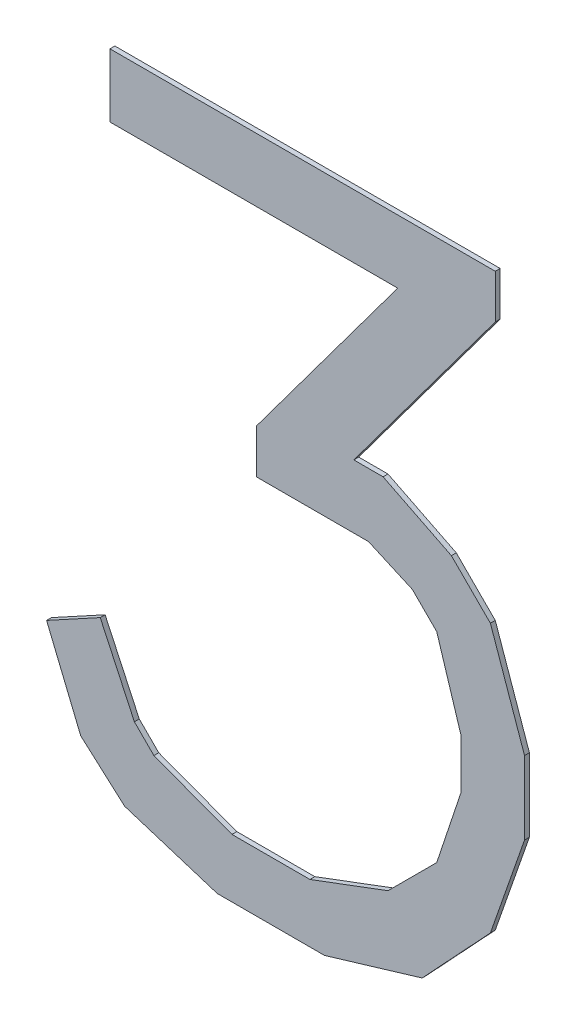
ISO-10303-21;
HEADER;
FILE_DESCRIPTION(('STEP AP214'),'2;1');
FILE_NAME('part.step','',(''),(''),'','','');
FILE_SCHEMA(('AUTOMOTIVE_DESIGN { 1 0 10303 214 1 1 1 1 }'));
ENDSEC;
DATA;
#1=APPLICATION_CONTEXT('core data for automotive mechanical design processes');
#2=APPLICATION_PROTOCOL_DEFINITION('international standard','automotive_design',2000,#1);
#3=PRODUCT_CONTEXT('',#1,'mechanical');
#4=PRODUCT('Part','Part','',(#3));
#5=PRODUCT_RELATED_PRODUCT_CATEGORY('part','',(#4));
#6=PRODUCT_DEFINITION_FORMATION('','',#4);
#7=PRODUCT_DEFINITION_CONTEXT('part definition',#1,'design');
#8=PRODUCT_DEFINITION('design','',#6,#7);
#9=PRODUCT_DEFINITION_SHAPE('','',#8);
#10=(LENGTH_UNIT() NAMED_UNIT(*) SI_UNIT(.MILLI.,.METRE.));
#11=(NAMED_UNIT(*) PLANE_ANGLE_UNIT() SI_UNIT($,.RADIAN.));
#12=(NAMED_UNIT(*) SI_UNIT($,.STERADIAN.) SOLID_ANGLE_UNIT());
#13=UNCERTAINTY_MEASURE_WITH_UNIT(LENGTH_MEASURE(1.E-05),#10,'distance_accuracy_value','');
#14=(GEOMETRIC_REPRESENTATION_CONTEXT(3) GLOBAL_UNCERTAINTY_ASSIGNED_CONTEXT((#13)) GLOBAL_UNIT_ASSIGNED_CONTEXT((#10,
#11,#12)) REPRESENTATION_CONTEXT('',''));
#15=CARTESIAN_POINT('',(0.,0.,0.));
#16=DIRECTION('',(0.,0.,1.));
#17=DIRECTION('',(1.,0.,0.));
#18=AXIS2_PLACEMENT_3D('',#15,#16,#17);
#19=CARTESIAN_POINT('',(-0.35999928,0.69499988,0.));
#20=DIRECTION('',(0.,0.,1.));
#21=DIRECTION('',(1.,0.,0.));
#22=AXIS2_PLACEMENT_3D('',#19,#20,#21);
#23=PLANE('',#22);
#24=DIRECTION('',(0.,1.,0.));
#25=VECTOR('',#24,1.);
#26=CARTESIAN_POINT('',(0.43000168,0.69499988,0.));
#27=LINE('',#26,#25);
#28=CARTESIAN_POINT('',(0.43000168,0.60500006,0.));
#29=VERTEX_POINT('',#28);
#30=CARTESIAN_POINT('',(0.43000168,0.69499988,0.));
#31=VERTEX_POINT('',#30);
#32=EDGE_CURVE('E387',#29,#31,#27,.T.);
#33=ORIENTED_EDGE('',*,*,#32,.F.);
#34=DIRECTION('',(0.59670362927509,0.802461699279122,0.));
#35=VECTOR('',#34,1.);
#36=CARTESIAN_POINT('',(0.43000168,0.60500006,0.));
#37=LINE('',#36,#35);
#38=CARTESIAN_POINT('',(0.139999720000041,0.21499829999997,0.));
#39=VERTEX_POINT('',#38);
#40=EDGE_CURVE('E382',#39,#29,#37,.T.);
#41=ORIENTED_EDGE('',*,*,#40,.F.);
#42=DIRECTION('',(1.,0.,0.));
#43=VECTOR('',#42,1.);
#44=CARTESIAN_POINT('',(0.13999972,0.2149983,0.));
#45=LINE('',#44,#43);
#46=CARTESIAN_POINT('',(0.20000214,0.2149983,0.));
#47=VERTEX_POINT('',#46);
#48=EDGE_CURVE('E377',#47,#39,#45,.F.);
#49=ORIENTED_EDGE('',*,*,#48,.F.);
#50=DIRECTION('',(-0.894427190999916,0.447213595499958,0.));
#51=VECTOR('',#50,1.);
#52=CARTESIAN_POINT('',(0.20000214,0.2149983,0.));
#53=LINE('',#52,#51);
#54=CARTESIAN_POINT('',(0.34000186,0.14499844,0.));
#55=VERTEX_POINT('',#54);
#56=EDGE_CURVE('E372',#55,#47,#53,.T.);
#57=ORIENTED_EDGE('',*,*,#56,.F.);
#58=DIRECTION('',(-0.707106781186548,0.707106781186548,0.));
#59=VECTOR('',#58,1.);
#60=CARTESIAN_POINT('',(0.34000186,0.14499844,0.));
#61=LINE('',#60,#59);
#62=CARTESIAN_POINT('',(0.4200017,0.0649986,0.));
#63=VERTEX_POINT('',#62);
#64=EDGE_CURVE('E367',#63,#55,#61,.T.);
#65=ORIENTED_EDGE('',*,*,#64,.F.);
#66=DIRECTION('',(-0.330350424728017,0.943858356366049,0.));
#67=VECTOR('',#66,1.);
#68=CARTESIAN_POINT('',(0.4200017,0.0649986,0.));
#69=LINE('',#68,#67);
#70=CARTESIAN_POINT('',(0.490001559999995,-0.135001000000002,0.));
#71=VERTEX_POINT('',#70);
#72=EDGE_CURVE('E362',#71,#63,#69,.T.);
#73=ORIENTED_EDGE('',*,*,#72,.F.);
#74=DIRECTION('',(0.,1.,0.));
#75=VECTOR('',#74,1.);
#76=CARTESIAN_POINT('',(0.49000156,-0.135001,0.));
#77=LINE('',#76,#75);
#78=CARTESIAN_POINT('',(0.49000156,-0.2850007,0.));
#79=VERTEX_POINT('',#78);
#80=EDGE_CURVE('E357',#79,#71,#77,.T.);
#81=ORIENTED_EDGE('',*,*,#80,.F.);
#82=DIRECTION('',(0.330350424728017,0.943858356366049,0.));
#83=VECTOR('',#82,1.);
#84=CARTESIAN_POINT('',(0.49000156,-0.2850007,0.));
#85=LINE('',#84,#83);
#86=CARTESIAN_POINT('',(0.420001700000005,-0.485000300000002,0.));
#87=VERTEX_POINT('',#86);
#88=EDGE_CURVE('E352',#87,#79,#85,.T.);
#89=ORIENTED_EDGE('',*,*,#88,.F.);
#90=DIRECTION('',(0.68231825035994,0.731055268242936,0.));
#91=VECTOR('',#90,1.);
#92=CARTESIAN_POINT('',(0.4200017,-0.4850003,0.));
#93=LINE('',#92,#91);
#94=CARTESIAN_POINT('',(0.280001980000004,-0.635000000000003,0.));
#95=VERTEX_POINT('',#94);
#96=EDGE_CURVE('E347',#95,#87,#93,.T.);
#97=ORIENTED_EDGE('',*,*,#96,.F.);
#98=DIRECTION('',(0.957827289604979,0.287344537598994,0.));
#99=VECTOR('',#98,1.);
#100=CARTESIAN_POINT('',(0.28000198,-0.635,0.));
#101=LINE('',#100,#99);
#102=CARTESIAN_POINT('',(0.0799998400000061,-0.694999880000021,0.));
#103=VERTEX_POINT('',#102);
#104=EDGE_CURVE('E342',#103,#95,#101,.T.);
#105=ORIENTED_EDGE('',*,*,#104,.F.);
#106=DIRECTION('',(1.,0.,0.));
#107=VECTOR('',#106,1.);
#108=CARTESIAN_POINT('',(0.07999984,-0.69499988,0.));
#109=LINE('',#108,#107);
#110=CARTESIAN_POINT('',(-0.13999972,-0.69499988,0.));
#111=VERTEX_POINT('',#110);
#112=EDGE_CURVE('E337',#111,#103,#109,.T.);
#113=ORIENTED_EDGE('',*,*,#112,.F.);
#114=DIRECTION('',(0.953582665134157,-0.30113136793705,0.));
#115=VECTOR('',#114,1.);
#116=CARTESIAN_POINT('',(-0.13999972,-0.69499988,0.));
#117=LINE('',#116,#115);
#118=CARTESIAN_POINT('',(-0.329999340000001,-0.635000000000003,0.));
#119=VERTEX_POINT('',#118);
#120=EDGE_CURVE('E332',#119,#111,#117,.T.);
#121=ORIENTED_EDGE('',*,*,#120,.F.);
#122=DIRECTION('',(0.74740931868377,-0.664363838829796,0.));
#123=VECTOR('',#122,1.);
#124=CARTESIAN_POINT('',(-0.32999934,-0.635,0.));
#125=LINE('',#124,#123);
#126=CARTESIAN_POINT('',(-0.419999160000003,-0.555000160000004,0.));
#127=VERTEX_POINT('',#126);
#128=EDGE_CURVE('E327',#127,#119,#125,.T.);
#129=ORIENTED_EDGE('',*,*,#128,.F.);
#130=DIRECTION('',(0.380749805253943,-0.924678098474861,0.));
#131=VECTOR('',#130,1.);
#132=CARTESIAN_POINT('',(-0.41999916,-0.55500016,0.));
#133=LINE('',#132,#131);
#134=CARTESIAN_POINT('',(-0.489999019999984,-0.385000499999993,0.));
#135=VERTEX_POINT('',#134);
#136=EDGE_CURVE('E322',#135,#127,#133,.T.);
#137=ORIENTED_EDGE('',*,*,#136,.F.);
#138=DIRECTION('',(-0.877895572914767,-0.478852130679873,0.));
#139=VECTOR('',#138,1.);
#140=CARTESIAN_POINT('',(-0.48999902,-0.3850005,0.));
#141=LINE('',#140,#139);
#142=CARTESIAN_POINT('',(-0.379999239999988,-0.325000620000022,0.));
#143=VERTEX_POINT('',#142);
#144=EDGE_CURVE('E317',#143,#135,#141,.T.);
#145=ORIENTED_EDGE('',*,*,#144,.F.);
#146=DIRECTION('',(-0.422885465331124,0.906183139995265,0.));
#147=VECTOR('',#146,1.);
#148=CARTESIAN_POINT('',(-0.37999924,-0.32500062,0.));
#149=LINE('',#148,#147);
#150=CARTESIAN_POINT('',(-0.30999938,-0.47500032,0.));
#151=VERTEX_POINT('',#150);
#152=EDGE_CURVE('E312',#151,#143,#149,.T.);
#153=ORIENTED_EDGE('',*,*,#152,.F.);
#154=DIRECTION('',(-0.707106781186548,0.707106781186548,0.));
#155=VECTOR('',#154,1.);
#156=CARTESIAN_POINT('',(-0.30999938,-0.47500032,0.));
#157=LINE('',#156,#155);
#158=CARTESIAN_POINT('',(-0.26999946,-0.51500024,0.));
#159=VERTEX_POINT('',#158);
#160=EDGE_CURVE('E307',#159,#151,#157,.T.);
#161=ORIENTED_EDGE('',*,*,#160,.F.);
#162=DIRECTION('',(-0.936329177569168,0.351123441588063,0.));
#163=VECTOR('',#162,1.);
#164=CARTESIAN_POINT('',(-0.26999946,-0.51500024,0.));
#165=LINE('',#164,#163);
#166=CARTESIAN_POINT('',(-0.109999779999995,-0.575000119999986,0.));
#167=VERTEX_POINT('',#166);
#168=EDGE_CURVE('E302',#167,#159,#165,.T.);
#169=ORIENTED_EDGE('',*,*,#168,.F.);
#170=DIRECTION('',(1.,0.,0.));
#171=VECTOR('',#170,1.);
#172=CARTESIAN_POINT('',(-0.10999978,-0.57500012,0.));
#173=LINE('',#172,#171);
#174=CARTESIAN_POINT('',(0.04999989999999,-0.57500012,0.));
#175=VERTEX_POINT('',#174);
#176=EDGE_CURVE('E297',#175,#167,#173,.F.);
#177=ORIENTED_EDGE('',*,*,#176,.F.);
#178=DIRECTION('',(-0.936331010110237,-0.351118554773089,0.));
#179=VECTOR('',#178,1.);
#180=CARTESIAN_POINT('',(0.04999989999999,-0.57500012,0.));
#181=LINE('',#180,#179);
#182=CARTESIAN_POINT('',(0.21000212,-0.515000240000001,0.));
#183=VERTEX_POINT('',#182);
#184=EDGE_CURVE('E292',#183,#175,#181,.T.);
#185=ORIENTED_EDGE('',*,*,#184,.F.);
#186=DIRECTION('',(-0.707106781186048,-0.707106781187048,0.));
#187=VECTOR('',#186,1.);
#188=CARTESIAN_POINT('',(0.21000212,-0.51500024,0.));
#189=LINE('',#188,#187);
#190=CARTESIAN_POINT('',(0.310001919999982,-0.415000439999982,0.));
#191=VERTEX_POINT('',#190);
#192=EDGE_CURVE('E287',#191,#183,#189,.T.);
#193=ORIENTED_EDGE('',*,*,#192,.F.);
#194=DIRECTION('',(-0.316227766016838,-0.948683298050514,0.));
#195=VECTOR('',#194,1.);
#196=CARTESIAN_POINT('',(0.31000192,-0.41500044,0.));
#197=LINE('',#196,#195);
#198=CARTESIAN_POINT('',(0.36000182,-0.26500074,0.));
#199=VERTEX_POINT('',#198);
#200=EDGE_CURVE('E282',#199,#191,#197,.T.);
#201=ORIENTED_EDGE('',*,*,#200,.F.);
#202=DIRECTION('',(0.,1.,0.));
#203=VECTOR('',#202,1.);
#204=CARTESIAN_POINT('',(0.36000182,-0.26500074,0.));
#205=LINE('',#204,#203);
#206=CARTESIAN_POINT('',(0.36000182,-0.16500094,0.));
#207=VERTEX_POINT('',#206);
#208=EDGE_CURVE('E277',#207,#199,#205,.F.);
#209=ORIENTED_EDGE('',*,*,#208,.F.);
#210=DIRECTION('',(0.298274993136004,-0.954479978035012,0.));
#211=VECTOR('',#210,1.);
#212=CARTESIAN_POINT('',(0.36000182,-0.16500094,0.));
#213=LINE('',#212,#211);
#214=CARTESIAN_POINT('',(0.310001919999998,-0.00500126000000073,0.));
#215=VERTEX_POINT('',#214);
#216=EDGE_CURVE('E272',#215,#207,#213,.T.);
#217=ORIENTED_EDGE('',*,*,#216,.F.);
#218=DIRECTION('',(0.707106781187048,-0.707106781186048,0.));
#219=VECTOR('',#218,1.);
#220=CARTESIAN_POINT('',(0.31000192,-0.00500126,0.));
#221=LINE('',#220,#219);
#222=CARTESIAN_POINT('',(0.260002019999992,0.0449986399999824,0.));
#223=VERTEX_POINT('',#222);
#224=EDGE_CURVE('E267',#223,#215,#221,.T.);
#225=ORIENTED_EDGE('',*,*,#224,.F.);
#226=DIRECTION('',(0.913815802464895,-0.406128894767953,0.));
#227=VECTOR('',#226,1.);
#228=CARTESIAN_POINT('',(0.26000202,0.04499863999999,0.));
#229=LINE('',#228,#227);
#230=CARTESIAN_POINT('',(0.169999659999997,0.0849985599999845,0.));
#231=VERTEX_POINT('',#230);
#232=EDGE_CURVE('E262',#231,#223,#229,.T.);
#233=ORIENTED_EDGE('',*,*,#232,.F.);
#234=DIRECTION('',(1.,0.,0.));
#235=VECTOR('',#234,1.);
#236=CARTESIAN_POINT('',(0.16999966,0.08499855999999,0.));
#237=LINE('',#236,#235);
#238=CARTESIAN_POINT('',(-0.05999988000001,0.08499855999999,0.));
#239=VERTEX_POINT('',#238);
#240=EDGE_CURVE('E257',#239,#231,#237,.T.);
#241=ORIENTED_EDGE('',*,*,#240,.F.);
#242=DIRECTION('',(0.,1.,0.));
#243=VECTOR('',#242,1.);
#244=CARTESIAN_POINT('',(-0.05999988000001,0.08499855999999,0.));
#245=LINE('',#244,#243);
#246=CARTESIAN_POINT('',(-0.05999988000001,0.17499838,0.));
#247=VERTEX_POINT('',#246);
#248=EDGE_CURVE('E252',#247,#239,#245,.F.);
#249=ORIENTED_EDGE('',*,*,#248,.F.);
#250=DIRECTION('',(-0.59670362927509,-0.802461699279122,0.));
#251=VECTOR('',#250,1.);
#252=CARTESIAN_POINT('',(-0.05999988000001,0.17499838,0.));
#253=LINE('',#252,#251);
#254=CARTESIAN_POINT('',(0.230002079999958,0.565000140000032,0.));
#255=VERTEX_POINT('',#254);
#256=EDGE_CURVE('E238',#255,#247,#253,.T.);
#257=ORIENTED_EDGE('',*,*,#256,.F.);
#258=DIRECTION('',(1.,0.,0.));
#259=VECTOR('',#258,1.);
#260=CARTESIAN_POINT('',(0.23000208,0.56500014,0.));
#261=LINE('',#260,#259);
#262=CARTESIAN_POINT('',(-0.35999928,0.56500014,0.));
#263=VERTEX_POINT('',#262);
#264=EDGE_CURVE('E223',#263,#255,#261,.T.);
#265=ORIENTED_EDGE('',*,*,#264,.F.);
#266=DIRECTION('',(0.,1.,0.));
#267=VECTOR('',#266,1.);
#268=CARTESIAN_POINT('',(-0.35999928,0.56500014,0.));
#269=LINE('',#268,#267);
#270=CARTESIAN_POINT('',(-0.35999928,0.69499988,0.));
#271=VERTEX_POINT('',#270);
#272=EDGE_CURVE('E20',#271,#263,#269,.F.);
#273=ORIENTED_EDGE('',*,*,#272,.F.);
#274=DIRECTION('',(1.,0.,0.));
#275=VECTOR('',#274,1.);
#276=CARTESIAN_POINT('',(-0.35999928,0.69499988,0.));
#277=LINE('',#276,#275);
#278=EDGE_CURVE('E391',#31,#271,#277,.F.);
#279=ORIENTED_EDGE('',*,*,#278,.F.);
#280=EDGE_LOOP('',(#33,#41,#49,#57,#65,#73,#81,#89,#97,#105,#113,#121,#129,#137,#145,#153,#161,
#169,#177,#185,#193,#201,#209,#217,#225,#233,#241,#249,#257,#265,#273,#279));
#281=FACE_BOUND('',#280,.T.);
#282=ADVANCED_FACE('F17',(#281),#23,.F.);
#283=CARTESIAN_POINT('',(-0.35999928,0.56500014,0.));
#284=DIRECTION('',(-1.,0.,0.));
#285=DIRECTION('',(0.,0.,1.));
#286=AXIS2_PLACEMENT_3D('',#283,#284,#285);
#287=PLANE('',#286);
#288=DIRECTION('',(0.,0.,1.));
#289=VECTOR('',#288,1.);
#290=CARTESIAN_POINT('',(-0.35999928,0.69499988,0.));
#291=LINE('',#290,#289);
#292=CARTESIAN_POINT('',(-0.35999928,0.69499988,0.01));
#293=VERTEX_POINT('',#292);
#294=EDGE_CURVE('E232',#271,#293,#291,.T.);
#295=ORIENTED_EDGE('',*,*,#294,.F.);
#296=ORIENTED_EDGE('',*,*,#272,.T.);
#297=DIRECTION('',(0.,0.,-1.));
#298=VECTOR('',#297,1.);
#299=CARTESIAN_POINT('',(-0.35999928,0.56500014,0.));
#300=LINE('',#299,#298);
#301=CARTESIAN_POINT('',(-0.35999928,0.56500014,0.01));
#302=VERTEX_POINT('',#301);
#303=EDGE_CURVE('E229',#302,#263,#300,.T.);
#304=ORIENTED_EDGE('',*,*,#303,.F.);
#305=DIRECTION('',(0.,1.,0.));
#306=VECTOR('',#305,1.);
#307=CARTESIAN_POINT('',(-0.35999928,0.69499988,0.01));
#308=LINE('',#307,#306);
#309=EDGE_CURVE('E393',#293,#302,#308,.F.);
#310=ORIENTED_EDGE('',*,*,#309,.F.);
#311=EDGE_LOOP('',(#295,#296,#304,#310));
#312=FACE_BOUND('',#311,.T.);
#313=ADVANCED_FACE('F228',(#312),#287,.T.);
#314=CARTESIAN_POINT('',(0.23000208,0.56500014,0.));
#315=DIRECTION('',(0.,-1.,0.));
#316=DIRECTION('',(0.,0.,-1.));
#317=AXIS2_PLACEMENT_3D('',#314,#315,#316);
#318=PLANE('',#317);
#319=ORIENTED_EDGE('',*,*,#303,.T.);
#320=ORIENTED_EDGE('',*,*,#264,.T.);
#321=DIRECTION('',(0.,0.,1.));
#322=VECTOR('',#321,1.);
#323=CARTESIAN_POINT('',(0.230002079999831,0.565000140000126,0.));
#324=LINE('',#323,#322);
#325=CARTESIAN_POINT('',(0.230002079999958,0.565000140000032,0.01));
#326=VERTEX_POINT('',#325);
#327=EDGE_CURVE('E240',#326,#255,#324,.F.);
#328=ORIENTED_EDGE('',*,*,#327,.F.);
#329=DIRECTION('',(1.,0.,0.));
#330=VECTOR('',#329,1.);
#331=CARTESIAN_POINT('',(-0.35999928,0.56500014,0.01));
#332=LINE('',#331,#330);
#333=EDGE_CURVE('E244',#302,#326,#332,.T.);
#334=ORIENTED_EDGE('',*,*,#333,.F.);
#335=EDGE_LOOP('',(#319,#320,#328,#334));
#336=FACE_BOUND('',#335,.T.);
#337=ADVANCED_FACE('F242',(#336),#318,.T.);
#338=CARTESIAN_POINT('',(-0.05999988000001,0.17499838,0.));
#339=DIRECTION('',(-0.802461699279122,0.59670362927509,0.));
#340=DIRECTION('',(-0.59670362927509,-0.802461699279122,0.));
#341=AXIS2_PLACEMENT_3D('',#338,#339,#340);
#342=PLANE('',#341);
#343=ORIENTED_EDGE('',*,*,#327,.T.);
#344=ORIENTED_EDGE('',*,*,#256,.T.);
#345=DIRECTION('',(0.,0.,1.));
#346=VECTOR('',#345,1.);
#347=CARTESIAN_POINT('',(-0.05999988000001,0.17499838,0.));
#348=LINE('',#347,#346);
#349=CARTESIAN_POINT('',(-0.05999988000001,0.17499838,0.01));
#350=VERTEX_POINT('',#349);
#351=EDGE_CURVE('E249',#350,#247,#348,.F.);
#352=ORIENTED_EDGE('',*,*,#351,.F.);
#353=DIRECTION('',(-0.596703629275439,-0.802461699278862,0.));
#354=VECTOR('',#353,1.);
#355=CARTESIAN_POINT('',(0.23000208,0.56500014,0.01));
#356=LINE('',#355,#354);
#357=EDGE_CURVE('E396',#326,#350,#356,.T.);
#358=ORIENTED_EDGE('',*,*,#357,.F.);
#359=EDGE_LOOP('',(#343,#344,#352,#358));
#360=FACE_BOUND('',#359,.T.);
#361=ADVANCED_FACE('F606',(#360),#342,.T.);
#362=CARTESIAN_POINT('',(-0.05999988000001,0.08499855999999,0.));
#363=DIRECTION('',(-1.,0.,0.));
#364=DIRECTION('',(0.,0.,1.));
#365=AXIS2_PLACEMENT_3D('',#362,#363,#364);
#366=PLANE('',#365);
#367=ORIENTED_EDGE('',*,*,#351,.T.);
#368=ORIENTED_EDGE('',*,*,#248,.T.);
#369=DIRECTION('',(0.,0.,-1.));
#370=VECTOR('',#369,1.);
#371=CARTESIAN_POINT('',(-0.05999988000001,0.08499855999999,0.));
#372=LINE('',#371,#370);
#373=CARTESIAN_POINT('',(-0.05999988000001,0.08499855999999,0.01));
#374=VERTEX_POINT('',#373);
#375=EDGE_CURVE('E254',#374,#239,#372,.T.);
#376=ORIENTED_EDGE('',*,*,#375,.F.);
#377=DIRECTION('',(0.,1.,0.));
#378=VECTOR('',#377,1.);
#379=CARTESIAN_POINT('',(-0.05999988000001,0.69499988,0.01));
#380=LINE('',#379,#378);
#381=EDGE_CURVE('E399',#350,#374,#380,.F.);
#382=ORIENTED_EDGE('',*,*,#381,.F.);
#383=EDGE_LOOP('',(#367,#368,#376,#382));
#384=FACE_BOUND('',#383,.T.);
#385=ADVANCED_FACE('F602',(#384),#366,.T.);
#386=CARTESIAN_POINT('',(0.16999966,0.08499855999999,0.));
#387=DIRECTION('',(0.,-1.,0.));
#388=DIRECTION('',(0.,0.,-1.));
#389=AXIS2_PLACEMENT_3D('',#386,#387,#388);
#390=PLANE('',#389);
#391=ORIENTED_EDGE('',*,*,#375,.T.);
#392=ORIENTED_EDGE('',*,*,#240,.T.);
#393=DIRECTION('',(0.,0.,1.));
#394=VECTOR('',#393,1.);
#395=CARTESIAN_POINT('',(0.16999965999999,0.0849985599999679,0.));
#396=LINE('',#395,#394);
#397=CARTESIAN_POINT('',(0.169999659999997,0.0849985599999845,0.01));
#398=VERTEX_POINT('',#397);
#399=EDGE_CURVE('E259',#398,#231,#396,.F.);
#400=ORIENTED_EDGE('',*,*,#399,.F.);
#401=DIRECTION('',(1.,0.,0.));
#402=VECTOR('',#401,1.);
#403=CARTESIAN_POINT('',(-0.35999928,0.08499855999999,0.01));
#404=LINE('',#403,#402);
#405=EDGE_CURVE('E402',#374,#398,#404,.T.);
#406=ORIENTED_EDGE('',*,*,#405,.F.);
#407=EDGE_LOOP('',(#391,#392,#400,#406));
#408=FACE_BOUND('',#407,.T.);
#409=ADVANCED_FACE('F598',(#408),#390,.T.);
#410=CARTESIAN_POINT('',(0.26000202,0.04499863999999,0.));
#411=DIRECTION('',(-0.406128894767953,-0.913815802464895,0.));
#412=DIRECTION('',(0.913815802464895,-0.406128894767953,0.));
#413=AXIS2_PLACEMENT_3D('',#410,#411,#412);
#414=PLANE('',#413);
#415=ORIENTED_EDGE('',*,*,#399,.T.);
#416=ORIENTED_EDGE('',*,*,#232,.T.);
#417=DIRECTION('',(0.,0.,1.));
#418=VECTOR('',#417,1.);
#419=CARTESIAN_POINT('',(0.26000201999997,0.0449986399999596,0.));
#420=LINE('',#419,#418);
#421=CARTESIAN_POINT('',(0.260002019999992,0.0449986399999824,0.01));
#422=VERTEX_POINT('',#421);
#423=EDGE_CURVE('E264',#422,#223,#420,.F.);
#424=ORIENTED_EDGE('',*,*,#423,.F.);
#425=DIRECTION('',(0.913815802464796,-0.406128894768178,0.));
#426=VECTOR('',#425,1.);
#427=CARTESIAN_POINT('',(0.16999966,0.08499855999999,0.01));
#428=LINE('',#427,#426);
#429=EDGE_CURVE('E405',#398,#422,#428,.T.);
#430=ORIENTED_EDGE('',*,*,#429,.F.);
#431=EDGE_LOOP('',(#415,#416,#424,#430));
#432=FACE_BOUND('',#431,.T.);
#433=ADVANCED_FACE('F594',(#432),#414,.T.);
#434=CARTESIAN_POINT('',(0.31000192,-0.00500126,0.));
#435=DIRECTION('',(-0.707106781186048,-0.707106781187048,0.));
#436=DIRECTION('',(0.707106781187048,-0.707106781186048,0.));
#437=AXIS2_PLACEMENT_3D('',#434,#435,#436);
#438=PLANE('',#437);
#439=ORIENTED_EDGE('',*,*,#423,.T.);
#440=ORIENTED_EDGE('',*,*,#224,.T.);
#441=DIRECTION('',(0.,0.,1.));
#442=VECTOR('',#441,1.);
#443=CARTESIAN_POINT('',(0.31000191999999,-0.00500126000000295,0.));
#444=LINE('',#443,#442);
#445=CARTESIAN_POINT('',(0.310001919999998,-0.00500126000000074,0.01));
#446=VERTEX_POINT('',#445);
#447=EDGE_CURVE('E269',#446,#215,#444,.F.);
#448=ORIENTED_EDGE('',*,*,#447,.F.);
#449=DIRECTION('',(0.707106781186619,-0.707106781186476,0.));
#450=VECTOR('',#449,1.);
#451=CARTESIAN_POINT('',(0.26000202,0.04499863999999,0.01));
#452=LINE('',#451,#450);
#453=EDGE_CURVE('E408',#422,#446,#452,.T.);
#454=ORIENTED_EDGE('',*,*,#453,.F.);
#455=EDGE_LOOP('',(#439,#440,#448,#454));
#456=FACE_BOUND('',#455,.T.);
#457=ADVANCED_FACE('F590',(#456),#438,.T.);
#458=CARTESIAN_POINT('',(0.36000182,-0.16500094,0.));
#459=DIRECTION('',(-0.954479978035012,-0.298274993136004,0.));
#460=DIRECTION('',(0.298274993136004,-0.954479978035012,0.));
#461=AXIS2_PLACEMENT_3D('',#458,#459,#460);
#462=PLANE('',#461);
#463=ORIENTED_EDGE('',*,*,#447,.T.);
#464=ORIENTED_EDGE('',*,*,#216,.T.);
#465=DIRECTION('',(0.,0.,1.));
#466=VECTOR('',#465,1.);
#467=CARTESIAN_POINT('',(0.36000182,-0.16500094,0.));
#468=LINE('',#467,#466);
#469=CARTESIAN_POINT('',(0.36000182,-0.16500094,0.01));
#470=VERTEX_POINT('',#469);
#471=EDGE_CURVE('E274',#470,#207,#468,.F.);
#472=ORIENTED_EDGE('',*,*,#471,.F.);
#473=DIRECTION('',(0.298274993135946,-0.95447997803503,0.));
#474=VECTOR('',#473,1.);
#475=CARTESIAN_POINT('',(0.31000192,-0.00500125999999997,0.01));
#476=LINE('',#475,#474);
#477=EDGE_CURVE('E411',#446,#470,#476,.T.);
#478=ORIENTED_EDGE('',*,*,#477,.F.);
#479=EDGE_LOOP('',(#463,#464,#472,#478));
#480=FACE_BOUND('',#479,.T.);
#481=ADVANCED_FACE('F586',(#480),#462,.T.);
#482=CARTESIAN_POINT('',(0.36000182,-0.26500074,0.));
#483=DIRECTION('',(-1.,0.,0.));
#484=DIRECTION('',(0.,0.,1.));
#485=AXIS2_PLACEMENT_3D('',#482,#483,#484);
#486=PLANE('',#485);
#487=ORIENTED_EDGE('',*,*,#471,.T.);
#488=ORIENTED_EDGE('',*,*,#208,.T.);
#489=DIRECTION('',(0.,0.,1.));
#490=VECTOR('',#489,1.);
#491=CARTESIAN_POINT('',(0.36000182,-0.26500074,0.));
#492=LINE('',#491,#490);
#493=CARTESIAN_POINT('',(0.36000182,-0.26500074,0.01));
#494=VERTEX_POINT('',#493);
#495=EDGE_CURVE('E279',#494,#199,#492,.F.);
#496=ORIENTED_EDGE('',*,*,#495,.F.);
#497=DIRECTION('',(0.,1.,0.));
#498=VECTOR('',#497,1.);
#499=CARTESIAN_POINT('',(0.36000182,0.69499988,0.01));
#500=LINE('',#499,#498);
#501=EDGE_CURVE('E414',#470,#494,#500,.F.);
#502=ORIENTED_EDGE('',*,*,#501,.F.);
#503=EDGE_LOOP('',(#487,#488,#496,#502));
#504=FACE_BOUND('',#503,.T.);
#505=ADVANCED_FACE('F582',(#504),#486,.T.);
#506=CARTESIAN_POINT('',(0.31000192,-0.41500044,0.));
#507=DIRECTION('',(-0.948683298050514,0.316227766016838,0.));
#508=DIRECTION('',(-0.316227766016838,-0.948683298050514,0.));
#509=AXIS2_PLACEMENT_3D('',#506,#507,#508);
#510=PLANE('',#509);
#511=ORIENTED_EDGE('',*,*,#495,.T.);
#512=ORIENTED_EDGE('',*,*,#200,.T.);
#513=DIRECTION('',(0.,0.,1.));
#514=VECTOR('',#513,1.);
#515=CARTESIAN_POINT('',(0.310001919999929,-0.415000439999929,0.));
#516=LINE('',#515,#514);
#517=CARTESIAN_POINT('',(0.310001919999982,-0.415000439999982,0.01));
#518=VERTEX_POINT('',#517);
#519=EDGE_CURVE('E284',#518,#191,#516,.F.);
#520=ORIENTED_EDGE('',*,*,#519,.F.);
#521=DIRECTION('',(-0.316227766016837,-0.948683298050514,0.));
#522=VECTOR('',#521,1.);
#523=CARTESIAN_POINT('',(0.36000182,-0.26500074,0.01));
#524=LINE('',#523,#522);
#525=EDGE_CURVE('E417',#494,#518,#524,.T.);
#526=ORIENTED_EDGE('',*,*,#525,.F.);
#527=EDGE_LOOP('',(#511,#512,#520,#526));
#528=FACE_BOUND('',#527,.T.);
#529=ADVANCED_FACE('F578',(#528),#510,.T.);
#530=CARTESIAN_POINT('',(0.21000212,-0.51500024,0.));
#531=DIRECTION('',(-0.707106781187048,0.707106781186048,0.));
#532=DIRECTION('',(-0.707106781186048,-0.707106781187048,0.));
#533=AXIS2_PLACEMENT_3D('',#530,#531,#532);
#534=PLANE('',#533);
#535=ORIENTED_EDGE('',*,*,#519,.T.);
#536=ORIENTED_EDGE('',*,*,#192,.T.);
#537=DIRECTION('',(0.,0.,1.));
#538=VECTOR('',#537,1.);
#539=CARTESIAN_POINT('',(0.210002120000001,-0.515000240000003,0.));
#540=LINE('',#539,#538);
#541=CARTESIAN_POINT('',(0.21000212,-0.515000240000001,0.01));
#542=VERTEX_POINT('',#541);
#543=EDGE_CURVE('E289',#542,#183,#540,.F.);
#544=ORIENTED_EDGE('',*,*,#543,.F.);
#545=DIRECTION('',(-0.707106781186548,-0.707106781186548,0.));
#546=VECTOR('',#545,1.);
#547=CARTESIAN_POINT('',(0.31000192,-0.41500044,0.01));
#548=LINE('',#547,#546);
#549=EDGE_CURVE('E420',#518,#542,#548,.T.);
#550=ORIENTED_EDGE('',*,*,#549,.F.);
#551=EDGE_LOOP('',(#535,#536,#544,#550));
#552=FACE_BOUND('',#551,.T.);
#553=ADVANCED_FACE('F574',(#552),#534,.T.);
#554=CARTESIAN_POINT('',(0.04999989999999,-0.57500012,0.));
#555=DIRECTION('',(-0.351118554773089,0.936331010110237,0.));
#556=DIRECTION('',(-0.936331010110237,-0.351118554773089,0.));
#557=AXIS2_PLACEMENT_3D('',#554,#555,#556);
#558=PLANE('',#557);
#559=ORIENTED_EDGE('',*,*,#543,.T.);
#560=ORIENTED_EDGE('',*,*,#184,.T.);
#561=DIRECTION('',(0.,0.,1.));
#562=VECTOR('',#561,1.);
#563=CARTESIAN_POINT('',(0.04999989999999,-0.57500012,0.));
#564=LINE('',#563,#562);
#565=CARTESIAN_POINT('',(0.04999989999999,-0.57500012,0.01));
#566=VERTEX_POINT('',#565);
#567=EDGE_CURVE('E294',#566,#175,#564,.F.);
#568=ORIENTED_EDGE('',*,*,#567,.F.);
#569=DIRECTION('',(-0.93633101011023,-0.351118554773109,0.));
#570=VECTOR('',#569,1.);
#571=CARTESIAN_POINT('',(0.21000212,-0.51500024,0.01));
#572=LINE('',#571,#570);
#573=EDGE_CURVE('E423',#542,#566,#572,.T.);
#574=ORIENTED_EDGE('',*,*,#573,.F.);
#575=EDGE_LOOP('',(#559,#560,#568,#574));
#576=FACE_BOUND('',#575,.T.);
#577=ADVANCED_FACE('F570',(#576),#558,.T.);
#578=CARTESIAN_POINT('',(-0.10999978,-0.57500012,0.));
#579=DIRECTION('',(0.,1.,0.));
#580=DIRECTION('',(0.,0.,1.));
#581=AXIS2_PLACEMENT_3D('',#578,#579,#580);
#582=PLANE('',#581);
#583=ORIENTED_EDGE('',*,*,#567,.T.);
#584=ORIENTED_EDGE('',*,*,#176,.T.);
#585=DIRECTION('',(0.,0.,1.));
#586=VECTOR('',#585,1.);
#587=CARTESIAN_POINT('',(-0.109999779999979,-0.575000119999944,0.));
#588=LINE('',#587,#586);
#589=CARTESIAN_POINT('',(-0.109999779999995,-0.575000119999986,0.01));
#590=VERTEX_POINT('',#589);
#591=EDGE_CURVE('E299',#590,#167,#588,.F.);
#592=ORIENTED_EDGE('',*,*,#591,.F.);
#593=DIRECTION('',(1.,0.,0.));
#594=VECTOR('',#593,1.);
#595=CARTESIAN_POINT('',(-0.35999928,-0.57500012,0.01));
#596=LINE('',#595,#594);
#597=EDGE_CURVE('E426',#566,#590,#596,.F.);
#598=ORIENTED_EDGE('',*,*,#597,.F.);
#599=EDGE_LOOP('',(#583,#584,#592,#598));
#600=FACE_BOUND('',#599,.T.);
#601=ADVANCED_FACE('F566',(#600),#582,.T.);
#602=CARTESIAN_POINT('',(-0.26999946,-0.51500024,0.));
#603=DIRECTION('',(0.351123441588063,0.936329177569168,0.));
#604=DIRECTION('',(-0.936329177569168,0.351123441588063,0.));
#605=AXIS2_PLACEMENT_3D('',#602,#603,#604);
#606=PLANE('',#605);
#607=ORIENTED_EDGE('',*,*,#591,.T.);
#608=ORIENTED_EDGE('',*,*,#168,.T.);
#609=DIRECTION('',(0.,0.,1.));
#610=VECTOR('',#609,1.);
#611=CARTESIAN_POINT('',(-0.26999946,-0.51500024,0.));
#612=LINE('',#611,#610);
#613=CARTESIAN_POINT('',(-0.26999946,-0.51500024,0.01));
#614=VERTEX_POINT('',#613);
#615=EDGE_CURVE('E304',#614,#159,#612,.F.);
#616=ORIENTED_EDGE('',*,*,#615,.F.);
#617=DIRECTION('',(-0.936329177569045,0.351123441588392,0.));
#618=VECTOR('',#617,1.);
#619=CARTESIAN_POINT('',(-0.10999978,-0.57500012,0.01));
#620=LINE('',#619,#618);
#621=EDGE_CURVE('E429',#590,#614,#620,.T.);
#622=ORIENTED_EDGE('',*,*,#621,.F.);
#623=EDGE_LOOP('',(#607,#608,#616,#622));
#624=FACE_BOUND('',#623,.T.);
#625=ADVANCED_FACE('F562',(#624),#606,.T.);
#626=CARTESIAN_POINT('',(-0.30999938,-0.47500032,0.));
#627=DIRECTION('',(0.707106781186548,0.707106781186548,0.));
#628=DIRECTION('',(-0.707106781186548,0.707106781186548,0.));
#629=AXIS2_PLACEMENT_3D('',#626,#627,#628);
#630=PLANE('',#629);
#631=ORIENTED_EDGE('',*,*,#615,.T.);
#632=ORIENTED_EDGE('',*,*,#160,.T.);
#633=DIRECTION('',(0.,0.,1.));
#634=VECTOR('',#633,1.);
#635=CARTESIAN_POINT('',(-0.30999938,-0.47500032,0.));
#636=LINE('',#635,#634);
#637=CARTESIAN_POINT('',(-0.30999938,-0.47500032,0.01));
#638=VERTEX_POINT('',#637);
#639=EDGE_CURVE('E309',#638,#151,#636,.F.);
#640=ORIENTED_EDGE('',*,*,#639,.F.);
#641=DIRECTION('',(-0.707106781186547,0.707106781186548,0.));
#642=VECTOR('',#641,1.);
#643=CARTESIAN_POINT('',(-0.26999946,-0.51500024,0.01));
#644=LINE('',#643,#642);
#645=EDGE_CURVE('E432',#614,#638,#644,.T.);
#646=ORIENTED_EDGE('',*,*,#645,.F.);
#647=EDGE_LOOP('',(#631,#632,#640,#646));
#648=FACE_BOUND('',#647,.T.);
#649=ADVANCED_FACE('F558',(#648),#630,.T.);
#650=CARTESIAN_POINT('',(-0.37999924,-0.32500062,0.));
#651=DIRECTION('',(0.906183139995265,0.422885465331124,0.));
#652=DIRECTION('',(-0.422885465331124,0.906183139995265,0.));
#653=AXIS2_PLACEMENT_3D('',#650,#651,#652);
#654=PLANE('',#653);
#655=ORIENTED_EDGE('',*,*,#639,.T.);
#656=ORIENTED_EDGE('',*,*,#152,.T.);
#657=DIRECTION('',(0.,0.,1.));
#658=VECTOR('',#657,1.);
#659=CARTESIAN_POINT('',(-0.379999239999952,-0.325000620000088,0.));
#660=LINE('',#659,#658);
#661=CARTESIAN_POINT('',(-0.379999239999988,-0.325000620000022,0.01));
#662=VERTEX_POINT('',#661);
#663=EDGE_CURVE('E314',#662,#143,#660,.F.);
#664=ORIENTED_EDGE('',*,*,#663,.F.);
#665=DIRECTION('',(-0.422885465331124,0.906183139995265,0.));
#666=VECTOR('',#665,1.);
#667=CARTESIAN_POINT('',(-0.30999938,-0.47500032,0.01));
#668=LINE('',#667,#666);
#669=EDGE_CURVE('E435',#638,#662,#668,.T.);
#670=ORIENTED_EDGE('',*,*,#669,.F.);
#671=EDGE_LOOP('',(#655,#656,#664,#670));
#672=FACE_BOUND('',#671,.T.);
#673=ADVANCED_FACE('F554',(#672),#654,.T.);
#674=CARTESIAN_POINT('',(-0.48999902,-0.3850005,0.));
#675=DIRECTION('',(-0.478852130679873,0.877895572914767,0.));
#676=DIRECTION('',(-0.877895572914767,-0.478852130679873,0.));
#677=AXIS2_PLACEMENT_3D('',#674,#675,#676);
#678=PLANE('',#677);
#679=ORIENTED_EDGE('',*,*,#663,.T.);
#680=ORIENTED_EDGE('',*,*,#144,.T.);
#681=DIRECTION('',(0.,0.,1.));
#682=VECTOR('',#681,1.);
#683=CARTESIAN_POINT('',(-0.489999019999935,-0.385000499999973,0.));
#684=LINE('',#683,#682);
#685=CARTESIAN_POINT('',(-0.489999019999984,-0.385000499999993,0.01));
#686=VERTEX_POINT('',#685);
#687=EDGE_CURVE('E319',#686,#135,#684,.F.);
#688=ORIENTED_EDGE('',*,*,#687,.F.);
#689=DIRECTION('',(-0.877895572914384,-0.478852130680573,0.));
#690=VECTOR('',#689,1.);
#691=CARTESIAN_POINT('',(-0.37999924,-0.32500062,0.01));
#692=LINE('',#691,#690);
#693=EDGE_CURVE('E438',#662,#686,#692,.T.);
#694=ORIENTED_EDGE('',*,*,#693,.F.);
#695=EDGE_LOOP('',(#679,#680,#688,#694));
#696=FACE_BOUND('',#695,.T.);
#697=ADVANCED_FACE('F550',(#696),#678,.T.);
#698=CARTESIAN_POINT('',(-0.41999916,-0.55500016,0.));
#699=DIRECTION('',(-0.924678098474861,-0.380749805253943,0.));
#700=DIRECTION('',(0.380749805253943,-0.924678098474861,0.));
#701=AXIS2_PLACEMENT_3D('',#698,#699,#700);
#702=PLANE('',#701);
#703=ORIENTED_EDGE('',*,*,#687,.T.);
#704=ORIENTED_EDGE('',*,*,#136,.T.);
#705=DIRECTION('',(0.,0.,1.));
#706=VECTOR('',#705,1.);
#707=CARTESIAN_POINT('',(-0.419999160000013,-0.555000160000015,0.));
#708=LINE('',#707,#706);
#709=CARTESIAN_POINT('',(-0.419999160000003,-0.555000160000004,0.01));
#710=VERTEX_POINT('',#709);
#711=EDGE_CURVE('E324',#710,#127,#708,.F.);
#712=ORIENTED_EDGE('',*,*,#711,.F.);
#713=DIRECTION('',(0.380749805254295,-0.924678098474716,0.));
#714=VECTOR('',#713,1.);
#715=CARTESIAN_POINT('',(-0.48999902,-0.3850005,0.01));
#716=LINE('',#715,#714);
#717=EDGE_CURVE('E441',#686,#710,#716,.T.);
#718=ORIENTED_EDGE('',*,*,#717,.F.);
#719=EDGE_LOOP('',(#703,#704,#712,#718));
#720=FACE_BOUND('',#719,.T.);
#721=ADVANCED_FACE('F546',(#720),#702,.T.);
#722=CARTESIAN_POINT('',(-0.32999934,-0.635,0.));
#723=DIRECTION('',(-0.664363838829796,-0.74740931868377,0.));
#724=DIRECTION('',(0.74740931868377,-0.664363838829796,0.));
#725=AXIS2_PLACEMENT_3D('',#722,#723,#724);
#726=PLANE('',#725);
#727=ORIENTED_EDGE('',*,*,#711,.T.);
#728=ORIENTED_EDGE('',*,*,#128,.T.);
#729=DIRECTION('',(0.,0.,1.));
#730=VECTOR('',#729,1.);
#731=CARTESIAN_POINT('',(-0.329999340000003,-0.63500000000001,0.));
#732=LINE('',#731,#730);
#733=CARTESIAN_POINT('',(-0.329999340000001,-0.635000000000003,0.01));
#734=VERTEX_POINT('',#733);
#735=EDGE_CURVE('E329',#734,#119,#732,.F.);
#736=ORIENTED_EDGE('',*,*,#735,.F.);
#737=DIRECTION('',(0.74740931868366,-0.664363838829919,0.));
#738=VECTOR('',#737,1.);
#739=CARTESIAN_POINT('',(-0.41999916,-0.55500016,0.01));
#740=LINE('',#739,#738);
#741=EDGE_CURVE('E444',#710,#734,#740,.T.);
#742=ORIENTED_EDGE('',*,*,#741,.F.);
#743=EDGE_LOOP('',(#727,#728,#736,#742));
#744=FACE_BOUND('',#743,.T.);
#745=ADVANCED_FACE('F542',(#744),#726,.T.);
#746=CARTESIAN_POINT('',(-0.13999972,-0.69499988,0.));
#747=DIRECTION('',(-0.30113136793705,-0.953582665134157,0.));
#748=DIRECTION('',(0.953582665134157,-0.30113136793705,0.));
#749=AXIS2_PLACEMENT_3D('',#746,#747,#748);
#750=PLANE('',#749);
#751=ORIENTED_EDGE('',*,*,#735,.T.);
#752=ORIENTED_EDGE('',*,*,#120,.T.);
#753=DIRECTION('',(0.,0.,-1.));
#754=VECTOR('',#753,1.);
#755=CARTESIAN_POINT('',(-0.13999972,-0.69499988,0.));
#756=LINE('',#755,#754);
#757=CARTESIAN_POINT('',(-0.13999972,-0.69499988,0.01));
#758=VERTEX_POINT('',#757);
#759=EDGE_CURVE('E334',#758,#111,#756,.T.);
#760=ORIENTED_EDGE('',*,*,#759,.F.);
#761=DIRECTION('',(0.953582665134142,-0.301131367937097,0.));
#762=VECTOR('',#761,1.);
#763=CARTESIAN_POINT('',(-0.32999934,-0.635,0.01));
#764=LINE('',#763,#762);
#765=EDGE_CURVE('E447',#734,#758,#764,.T.);
#766=ORIENTED_EDGE('',*,*,#765,.F.);
#767=EDGE_LOOP('',(#751,#752,#760,#766));
#768=FACE_BOUND('',#767,.T.);
#769=ADVANCED_FACE('F538',(#768),#750,.T.);
#770=CARTESIAN_POINT('',(0.07999984,-0.69499988,0.));
#771=DIRECTION('',(0.,-1.,0.));
#772=DIRECTION('',(0.,0.,-1.));
#773=AXIS2_PLACEMENT_3D('',#770,#771,#772);
#774=PLANE('',#773);
#775=ORIENTED_EDGE('',*,*,#759,.T.);
#776=ORIENTED_EDGE('',*,*,#112,.T.);
#777=DIRECTION('',(0.,0.,1.));
#778=VECTOR('',#777,1.);
#779=CARTESIAN_POINT('',(0.0799998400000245,-0.694999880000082,0.));
#780=LINE('',#779,#778);
#781=CARTESIAN_POINT('',(0.0799998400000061,-0.694999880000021,0.01));
#782=VERTEX_POINT('',#781);
#783=EDGE_CURVE('E339',#782,#103,#780,.F.);
#784=ORIENTED_EDGE('',*,*,#783,.F.);
#785=DIRECTION('',(1.,0.,0.));
#786=VECTOR('',#785,1.);
#787=CARTESIAN_POINT('',(-0.35999928,-0.69499988,0.01));
#788=LINE('',#787,#786);
#789=EDGE_CURVE('E450',#758,#782,#788,.T.);
#790=ORIENTED_EDGE('',*,*,#789,.F.);
#791=EDGE_LOOP('',(#775,#776,#784,#790));
#792=FACE_BOUND('',#791,.T.);
#793=ADVANCED_FACE('F534',(#792),#774,.T.);
#794=CARTESIAN_POINT('',(0.28000198,-0.635,0.));
#795=DIRECTION('',(0.287344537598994,-0.957827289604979,0.));
#796=DIRECTION('',(0.957827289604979,0.287344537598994,0.));
#797=AXIS2_PLACEMENT_3D('',#794,#795,#796);
#798=PLANE('',#797);
#799=ORIENTED_EDGE('',*,*,#783,.T.);
#800=ORIENTED_EDGE('',*,*,#104,.T.);
#801=DIRECTION('',(0.,0.,1.));
#802=VECTOR('',#801,1.);
#803=CARTESIAN_POINT('',(0.280001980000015,-0.635000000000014,0.));
#804=LINE('',#803,#802);
#805=CARTESIAN_POINT('',(0.280001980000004,-0.635000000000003,0.01));
#806=VERTEX_POINT('',#805);
#807=EDGE_CURVE('E344',#806,#95,#804,.F.);
#808=ORIENTED_EDGE('',*,*,#807,.F.);
#809=DIRECTION('',(0.957827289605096,0.287344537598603,0.));
#810=VECTOR('',#809,1.);
#811=CARTESIAN_POINT('',(0.07999984,-0.69499988,0.01));
#812=LINE('',#811,#810);
#813=EDGE_CURVE('E453',#782,#806,#812,.T.);
#814=ORIENTED_EDGE('',*,*,#813,.F.);
#815=EDGE_LOOP('',(#799,#800,#808,#814));
#816=FACE_BOUND('',#815,.T.);
#817=ADVANCED_FACE('F530',(#816),#798,.T.);
#818=CARTESIAN_POINT('',(0.4200017,-0.4850003,0.));
#819=DIRECTION('',(0.731055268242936,-0.68231825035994,0.));
#820=DIRECTION('',(0.68231825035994,0.731055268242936,0.));
#821=AXIS2_PLACEMENT_3D('',#818,#819,#820);
#822=PLANE('',#821);
#823=ORIENTED_EDGE('',*,*,#807,.T.);
#824=ORIENTED_EDGE('',*,*,#96,.T.);
#825=DIRECTION('',(0.,0.,1.));
#826=VECTOR('',#825,1.);
#827=CARTESIAN_POINT('',(0.420001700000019,-0.485000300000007,0.));
#828=LINE('',#827,#826);
#829=CARTESIAN_POINT('',(0.420001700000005,-0.485000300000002,0.01));
#830=VERTEX_POINT('',#829);
#831=EDGE_CURVE('E349',#830,#87,#828,.F.);
#832=ORIENTED_EDGE('',*,*,#831,.F.);
#833=DIRECTION('',(0.682318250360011,0.731055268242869,0.));
#834=VECTOR('',#833,1.);
#835=CARTESIAN_POINT('',(0.28000198,-0.635,0.01));
#836=LINE('',#835,#834);
#837=EDGE_CURVE('E456',#806,#830,#836,.T.);
#838=ORIENTED_EDGE('',*,*,#837,.F.);
#839=EDGE_LOOP('',(#823,#824,#832,#838));
#840=FACE_BOUND('',#839,.T.);
#841=ADVANCED_FACE('F526',(#840),#822,.T.);
#842=CARTESIAN_POINT('',(0.49000156,-0.2850007,0.));
#843=DIRECTION('',(0.943858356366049,-0.330350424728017,0.));
#844=DIRECTION('',(0.330350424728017,0.943858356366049,0.));
#845=AXIS2_PLACEMENT_3D('',#842,#843,#844);
#846=PLANE('',#845);
#847=ORIENTED_EDGE('',*,*,#831,.T.);
#848=ORIENTED_EDGE('',*,*,#88,.T.);
#849=DIRECTION('',(0.,0.,-1.));
#850=VECTOR('',#849,1.);
#851=CARTESIAN_POINT('',(0.49000156,-0.2850007,0.));
#852=LINE('',#851,#850);
#853=CARTESIAN_POINT('',(0.49000156,-0.2850007,0.01));
#854=VERTEX_POINT('',#853);
#855=EDGE_CURVE('E354',#854,#79,#852,.T.);
#856=ORIENTED_EDGE('',*,*,#855,.F.);
#857=DIRECTION('',(0.330350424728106,0.943858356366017,0.));
#858=VECTOR('',#857,1.);
#859=CARTESIAN_POINT('',(0.4200017,-0.4850003,0.01));
#860=LINE('',#859,#858);
#861=EDGE_CURVE('E459',#830,#854,#860,.T.);
#862=ORIENTED_EDGE('',*,*,#861,.F.);
#863=EDGE_LOOP('',(#847,#848,#856,#862));
#864=FACE_BOUND('',#863,.T.);
#865=ADVANCED_FACE('F522',(#864),#846,.T.);
#866=CARTESIAN_POINT('',(0.49000156,-0.135001,0.));
#867=DIRECTION('',(1.,0.,0.));
#868=DIRECTION('',(0.,0.,-1.));
#869=AXIS2_PLACEMENT_3D('',#866,#867,#868);
#870=PLANE('',#869);
#871=ORIENTED_EDGE('',*,*,#855,.T.);
#872=ORIENTED_EDGE('',*,*,#80,.T.);
#873=DIRECTION('',(0.,0.,1.));
#874=VECTOR('',#873,1.);
#875=CARTESIAN_POINT('',(0.490001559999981,-0.135001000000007,0.));
#876=LINE('',#875,#874);
#877=CARTESIAN_POINT('',(0.490001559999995,-0.135001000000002,0.01));
#878=VERTEX_POINT('',#877);
#879=EDGE_CURVE('E359',#878,#71,#876,.F.);
#880=ORIENTED_EDGE('',*,*,#879,.F.);
#881=DIRECTION('',(0.,1.,0.));
#882=VECTOR('',#881,1.);
#883=CARTESIAN_POINT('',(0.49000156,0.69499988,0.01));
#884=LINE('',#883,#882);
#885=EDGE_CURVE('E462',#854,#878,#884,.T.);
#886=ORIENTED_EDGE('',*,*,#885,.F.);
#887=EDGE_LOOP('',(#871,#872,#880,#886));
#888=FACE_BOUND('',#887,.T.);
#889=ADVANCED_FACE('F518',(#888),#870,.T.);
#890=CARTESIAN_POINT('',(0.4200017,0.0649986,0.));
#891=DIRECTION('',(0.943858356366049,0.330350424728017,0.));
#892=DIRECTION('',(-0.330350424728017,0.943858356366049,0.));
#893=AXIS2_PLACEMENT_3D('',#890,#891,#892);
#894=PLANE('',#893);
#895=ORIENTED_EDGE('',*,*,#879,.T.);
#896=ORIENTED_EDGE('',*,*,#72,.T.);
#897=DIRECTION('',(0.,0.,1.));
#898=VECTOR('',#897,1.);
#899=CARTESIAN_POINT('',(0.4200017,0.0649986,0.));
#900=LINE('',#899,#898);
#901=CARTESIAN_POINT('',(0.4200017,0.0649986,0.01));
#902=VERTEX_POINT('',#901);
#903=EDGE_CURVE('E364',#902,#63,#900,.F.);
#904=ORIENTED_EDGE('',*,*,#903,.F.);
#905=DIRECTION('',(-0.330350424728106,0.943858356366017,0.));
#906=VECTOR('',#905,1.);
#907=CARTESIAN_POINT('',(0.49000156,-0.135001,0.01));
#908=LINE('',#907,#906);
#909=EDGE_CURVE('E465',#878,#902,#908,.T.);
#910=ORIENTED_EDGE('',*,*,#909,.F.);
#911=EDGE_LOOP('',(#895,#896,#904,#910));
#912=FACE_BOUND('',#911,.T.);
#913=ADVANCED_FACE('F514',(#912),#894,.T.);
#914=CARTESIAN_POINT('',(0.34000186,0.14499844,0.));
#915=DIRECTION('',(0.707106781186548,0.707106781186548,0.));
#916=DIRECTION('',(-0.707106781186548,0.707106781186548,0.));
#917=AXIS2_PLACEMENT_3D('',#914,#915,#916);
#918=PLANE('',#917);
#919=ORIENTED_EDGE('',*,*,#903,.T.);
#920=ORIENTED_EDGE('',*,*,#64,.T.);
#921=DIRECTION('',(0.,0.,1.));
#922=VECTOR('',#921,1.);
#923=CARTESIAN_POINT('',(0.34000186,0.14499844,0.));
#924=LINE('',#923,#922);
#925=CARTESIAN_POINT('',(0.34000186,0.14499844,0.01));
#926=VERTEX_POINT('',#925);
#927=EDGE_CURVE('E369',#926,#55,#924,.F.);
#928=ORIENTED_EDGE('',*,*,#927,.F.);
#929=DIRECTION('',(-0.707106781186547,0.707106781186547,0.));
#930=VECTOR('',#929,1.);
#931=CARTESIAN_POINT('',(0.4200017,0.0649986,0.01));
#932=LINE('',#931,#930);
#933=EDGE_CURVE('E468',#902,#926,#932,.T.);
#934=ORIENTED_EDGE('',*,*,#933,.F.);
#935=EDGE_LOOP('',(#919,#920,#928,#934));
#936=FACE_BOUND('',#935,.T.);
#937=ADVANCED_FACE('F510',(#936),#918,.T.);
#938=CARTESIAN_POINT('',(0.20000214,0.2149983,0.));
#939=DIRECTION('',(0.447213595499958,0.894427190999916,0.));
#940=DIRECTION('',(-0.894427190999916,0.447213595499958,0.));
#941=AXIS2_PLACEMENT_3D('',#938,#939,#940);
#942=PLANE('',#941);
#943=ORIENTED_EDGE('',*,*,#927,.T.);
#944=ORIENTED_EDGE('',*,*,#56,.T.);
#945=DIRECTION('',(0.,0.,1.));
#946=VECTOR('',#945,1.);
#947=CARTESIAN_POINT('',(0.20000214,0.2149983,0.));
#948=LINE('',#947,#946);
#949=CARTESIAN_POINT('',(0.20000214,0.2149983,0.01));
#950=VERTEX_POINT('',#949);
#951=EDGE_CURVE('E374',#950,#47,#948,.F.);
#952=ORIENTED_EDGE('',*,*,#951,.F.);
#953=DIRECTION('',(-0.894427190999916,0.447213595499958,0.));
#954=VECTOR('',#953,1.);
#955=CARTESIAN_POINT('',(0.34000186,0.14499844,0.01));
#956=LINE('',#955,#954);
#957=EDGE_CURVE('E471',#926,#950,#956,.T.);
#958=ORIENTED_EDGE('',*,*,#957,.F.);
#959=EDGE_LOOP('',(#943,#944,#952,#958));
#960=FACE_BOUND('',#959,.T.);
#961=ADVANCED_FACE('F506',(#960),#942,.T.);
#962=CARTESIAN_POINT('',(0.13999972,0.2149983,0.));
#963=DIRECTION('',(0.,1.,0.));
#964=DIRECTION('',(0.,0.,1.));
#965=AXIS2_PLACEMENT_3D('',#962,#963,#964);
#966=PLANE('',#965);
#967=ORIENTED_EDGE('',*,*,#951,.T.);
#968=ORIENTED_EDGE('',*,*,#48,.T.);
#969=DIRECTION('',(0.,0.,1.));
#970=VECTOR('',#969,1.);
#971=CARTESIAN_POINT('',(0.139999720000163,0.214998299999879,0.));
#972=LINE('',#971,#970);
#973=CARTESIAN_POINT('',(0.139999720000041,0.21499829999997,0.01));
#974=VERTEX_POINT('',#973);
#975=EDGE_CURVE('E379',#974,#39,#972,.F.);
#976=ORIENTED_EDGE('',*,*,#975,.F.);
#977=DIRECTION('',(1.,0.,0.));
#978=VECTOR('',#977,1.);
#979=CARTESIAN_POINT('',(-0.35999928,0.2149983,0.01));
#980=LINE('',#979,#978);
#981=EDGE_CURVE('E474',#950,#974,#980,.F.);
#982=ORIENTED_EDGE('',*,*,#981,.F.);
#983=EDGE_LOOP('',(#967,#968,#976,#982));
#984=FACE_BOUND('',#983,.T.);
#985=ADVANCED_FACE('F503',(#984),#966,.T.);
#986=CARTESIAN_POINT('',(0.43000168,0.60500006,0.));
#987=DIRECTION('',(0.802461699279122,-0.59670362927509,0.));
#988=DIRECTION('',(0.59670362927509,0.802461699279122,0.));
#989=AXIS2_PLACEMENT_3D('',#986,#987,#988);
#990=PLANE('',#989);
#991=ORIENTED_EDGE('',*,*,#975,.T.);
#992=ORIENTED_EDGE('',*,*,#40,.T.);
#993=DIRECTION('',(0.,0.,-1.));
#994=VECTOR('',#993,1.);
#995=CARTESIAN_POINT('',(0.43000168,0.60500006,0.));
#996=LINE('',#995,#994);
#997=CARTESIAN_POINT('',(0.43000168,0.60500006,0.01));
#998=VERTEX_POINT('',#997);
#999=EDGE_CURVE('E384',#998,#29,#996,.T.);
#1000=ORIENTED_EDGE('',*,*,#999,.F.);
#1001=DIRECTION('',(0.596703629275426,0.802461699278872,0.));
#1002=VECTOR('',#1001,1.);
#1003=CARTESIAN_POINT('',(0.13999972,0.2149983,0.01));
#1004=LINE('',#1003,#1002);
#1005=EDGE_CURVE('E477',#974,#998,#1004,.T.);
#1006=ORIENTED_EDGE('',*,*,#1005,.F.);
#1007=EDGE_LOOP('',(#991,#992,#1000,#1006));
#1008=FACE_BOUND('',#1007,.T.);
#1009=ADVANCED_FACE('F486',(#1008),#990,.T.);
#1010=CARTESIAN_POINT('',(0.43000168,0.69499988,0.));
#1011=DIRECTION('',(1.,0.,0.));
#1012=DIRECTION('',(0.,0.,-1.));
#1013=AXIS2_PLACEMENT_3D('',#1010,#1011,#1012);
#1014=PLANE('',#1013);
#1015=ORIENTED_EDGE('',*,*,#999,.T.);
#1016=ORIENTED_EDGE('',*,*,#32,.T.);
#1017=DIRECTION('',(0.,0.,1.));
#1018=VECTOR('',#1017,1.);
#1019=CARTESIAN_POINT('',(0.43000168,0.69499988,0.));
#1020=LINE('',#1019,#1018);
#1021=CARTESIAN_POINT('',(0.43000168,0.69499988,0.01));
#1022=VERTEX_POINT('',#1021);
#1023=EDGE_CURVE('E35',#1022,#31,#1020,.F.);
#1024=ORIENTED_EDGE('',*,*,#1023,.F.);
#1025=DIRECTION('',(0.,1.,0.));
#1026=VECTOR('',#1025,1.);
#1027=CARTESIAN_POINT('',(0.43000168,0.69499988,0.01));
#1028=LINE('',#1027,#1026);
#1029=EDGE_CURVE('E26',#998,#1022,#1028,.T.);
#1030=ORIENTED_EDGE('',*,*,#1029,.F.);
#1031=EDGE_LOOP('',(#1015,#1016,#1024,#1030));
#1032=FACE_BOUND('',#1031,.T.);
#1033=ADVANCED_FACE('F484',(#1032),#1014,.T.);
#1034=CARTESIAN_POINT('',(-0.35999928,0.69499988,0.));
#1035=DIRECTION('',(0.,1.,0.));
#1036=DIRECTION('',(0.,0.,1.));
#1037=AXIS2_PLACEMENT_3D('',#1034,#1035,#1036);
#1038=PLANE('',#1037);
#1039=ORIENTED_EDGE('',*,*,#1023,.T.);
#1040=ORIENTED_EDGE('',*,*,#278,.T.);
#1041=ORIENTED_EDGE('',*,*,#294,.T.);
#1042=DIRECTION('',(1.,0.,0.));
#1043=VECTOR('',#1042,1.);
#1044=CARTESIAN_POINT('',(-0.35999928,0.69499988,0.01));
#1045=LINE('',#1044,#1043);
#1046=EDGE_CURVE('E11',#1022,#293,#1045,.F.);
#1047=ORIENTED_EDGE('',*,*,#1046,.F.);
#1048=EDGE_LOOP('',(#1039,#1040,#1041,#1047));
#1049=FACE_BOUND('',#1048,.T.);
#1050=ADVANCED_FACE('F490',(#1049),#1038,.T.);
#1051=CARTESIAN_POINT('',(-0.35999928,0.69499988,0.01));
#1052=DIRECTION('',(0.,0.,1.));
#1053=DIRECTION('',(1.,0.,0.));
#1054=AXIS2_PLACEMENT_3D('',#1051,#1052,#1053);
#1055=PLANE('',#1054);
#1056=ORIENTED_EDGE('',*,*,#1029,.T.);
#1057=ORIENTED_EDGE('',*,*,#1046,.T.);
#1058=ORIENTED_EDGE('',*,*,#309,.T.);
#1059=ORIENTED_EDGE('',*,*,#333,.T.);
#1060=ORIENTED_EDGE('',*,*,#357,.T.);
#1061=ORIENTED_EDGE('',*,*,#381,.T.);
#1062=ORIENTED_EDGE('',*,*,#405,.T.);
#1063=ORIENTED_EDGE('',*,*,#429,.T.);
#1064=ORIENTED_EDGE('',*,*,#453,.T.);
#1065=ORIENTED_EDGE('',*,*,#477,.T.);
#1066=ORIENTED_EDGE('',*,*,#501,.T.);
#1067=ORIENTED_EDGE('',*,*,#525,.T.);
#1068=ORIENTED_EDGE('',*,*,#549,.T.);
#1069=ORIENTED_EDGE('',*,*,#573,.T.);
#1070=ORIENTED_EDGE('',*,*,#597,.T.);
#1071=ORIENTED_EDGE('',*,*,#621,.T.);
#1072=ORIENTED_EDGE('',*,*,#645,.T.);
#1073=ORIENTED_EDGE('',*,*,#669,.T.);
#1074=ORIENTED_EDGE('',*,*,#693,.T.);
#1075=ORIENTED_EDGE('',*,*,#717,.T.);
#1076=ORIENTED_EDGE('',*,*,#741,.T.);
#1077=ORIENTED_EDGE('',*,*,#765,.T.);
#1078=ORIENTED_EDGE('',*,*,#789,.T.);
#1079=ORIENTED_EDGE('',*,*,#813,.T.);
#1080=ORIENTED_EDGE('',*,*,#837,.T.);
#1081=ORIENTED_EDGE('',*,*,#861,.T.);
#1082=ORIENTED_EDGE('',*,*,#885,.T.);
#1083=ORIENTED_EDGE('',*,*,#909,.T.);
#1084=ORIENTED_EDGE('',*,*,#933,.T.);
#1085=ORIENTED_EDGE('',*,*,#957,.T.);
#1086=ORIENTED_EDGE('',*,*,#981,.T.);
#1087=ORIENTED_EDGE('',*,*,#1005,.T.);
#1088=EDGE_LOOP('',(#1056,#1057,#1058,#1059,#1060,#1061,#1062,#1063,#1064,#1065,#1066,#1067,
#1068,#1069,#1070,#1071,#1072,#1073,#1074,#1075,#1076,#1077,#1078,#1079,#1080,#1081,#1082,#1083,
#1084,#1085,#1086,#1087));
#1089=FACE_BOUND('',#1088,.T.);
#1090=ADVANCED_FACE('F482',(#1089),#1055,.T.);
#1091=CLOSED_SHELL('',(#282,#313,#337,#361,#385,#409,#433,#457,#481,#505,#529,#553,#577,#601,
#625,#649,#673,#697,#721,#745,#769,#793,#817,#841,#865,#889,#913,#937,#961,#985,#1009,#1033,
#1050,#1090));
#1092=MANIFOLD_SOLID_BREP('B1',#1091);
#1093=ADVANCED_BREP_SHAPE_REPRESENTATION('',(#18,#1092),#14);
#1094=SHAPE_DEFINITION_REPRESENTATION(#9,#1093);
ENDSEC;
END-ISO-10303-21;
